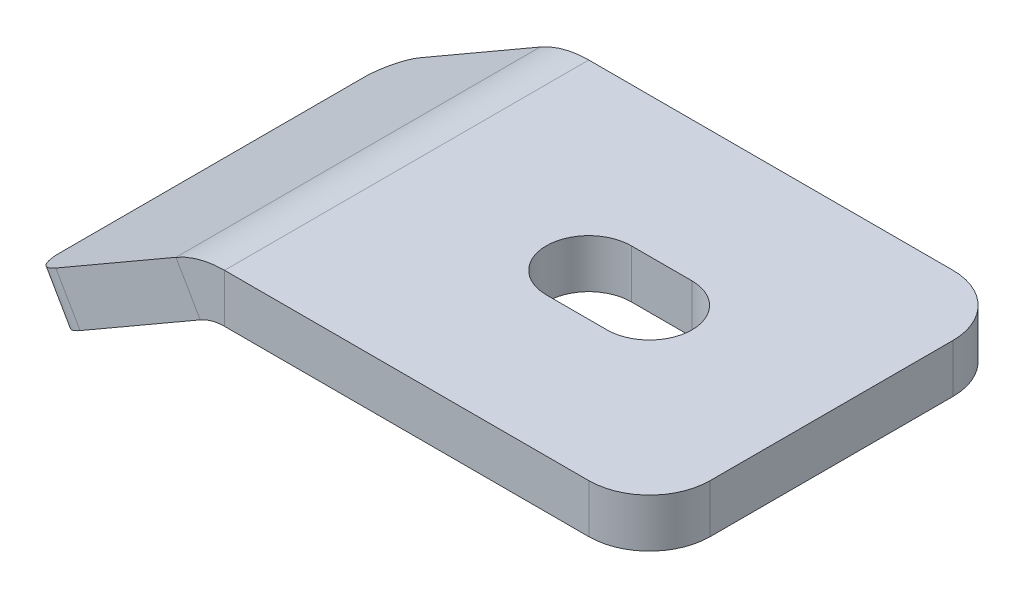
ISO-10303-21;
HEADER;
FILE_DESCRIPTION(('STEP AP214'),'2;1');
FILE_NAME('part.step','',(''),(''),'','','');
FILE_SCHEMA(('AUTOMOTIVE_DESIGN { 1 0 10303 214 1 1 1 1 }'));
ENDSEC;
DATA;
#1=APPLICATION_CONTEXT('core data for automotive mechanical design processes');
#2=APPLICATION_PROTOCOL_DEFINITION('international standard','automotive_design',2000,#1);
#3=PRODUCT_CONTEXT('',#1,'mechanical');
#4=PRODUCT('Part','Part','',(#3));
#5=PRODUCT_RELATED_PRODUCT_CATEGORY('part','',(#4));
#6=PRODUCT_DEFINITION_FORMATION('','',#4);
#7=PRODUCT_DEFINITION_CONTEXT('part definition',#1,'design');
#8=PRODUCT_DEFINITION('design','',#6,#7);
#9=PRODUCT_DEFINITION_SHAPE('','',#8);
#10=(LENGTH_UNIT() NAMED_UNIT(*) SI_UNIT(.MILLI.,.METRE.));
#11=(NAMED_UNIT(*) PLANE_ANGLE_UNIT() SI_UNIT($,.RADIAN.));
#12=(NAMED_UNIT(*) SI_UNIT($,.STERADIAN.) SOLID_ANGLE_UNIT());
#13=UNCERTAINTY_MEASURE_WITH_UNIT(LENGTH_MEASURE(1.E-05),#10,'distance_accuracy_value','');
#14=(GEOMETRIC_REPRESENTATION_CONTEXT(3) GLOBAL_UNCERTAINTY_ASSIGNED_CONTEXT((#13)) GLOBAL_UNIT_ASSIGNED_CONTEXT((#10,
#11,#12)) REPRESENTATION_CONTEXT('',''));
#15=CARTESIAN_POINT('',(0.,0.,0.));
#16=DIRECTION('',(0.,0.,1.));
#17=DIRECTION('',(1.,0.,0.));
#18=AXIS2_PLACEMENT_3D('',#15,#16,#17);
#19=CARTESIAN_POINT('',(-58.7942286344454,-20.499999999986,30.0000000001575));
#20=DIRECTION('',(0.,0.,1.));
#21=DIRECTION('',(0.866025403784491,0.500000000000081,0.));
#22=AXIS2_PLACEMENT_3D('',#19,#20,#21);
#23=PLANE('',#22);
#24=DIRECTION('',(0.866025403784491,0.500000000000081,0.));
#25=VECTOR('',#24,1.);
#26=CARTESIAN_POINT('',(-58.7942286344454,-20.499999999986,30.0000000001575));
#27=LINE('',#26,#25);
#28=CARTESIAN_POINT('',(-58.7942286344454,-20.499999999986,30.0000000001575));
#29=VERTEX_POINT('',#28);
#30=CARTESIAN_POINT('',(-39.0000000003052,-9.07179676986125,30.0000000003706));
#31=VERTEX_POINT('',#30);
#32=EDGE_CURVE('E279',#29,#31,#27,.T.);
#33=ORIENTED_EDGE('',*,*,#32,.T.);
#34=DIRECTION('',(-0.499999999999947,0.866025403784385,0.));
#35=VECTOR('',#34,1.);
#36=CARTESIAN_POINT('',(-39.0000000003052,-9.07179676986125,30.0000000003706));
#37=LINE('',#36,#35);
#38=CARTESIAN_POINT('',(-43.0000000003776,-2.14359353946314,30.0000000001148));
#39=VERTEX_POINT('',#38);
#40=EDGE_CURVE('E12',#31,#39,#37,.T.);
#41=ORIENTED_EDGE('',*,*,#40,.T.);
#42=DIRECTION('',(0.866025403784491,0.500000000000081,0.));
#43=VECTOR('',#42,1.);
#44=CARTESIAN_POINT('',(-62.794228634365,-13.5717967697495,29.9999999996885));
#45=LINE('',#44,#43);
#46=CARTESIAN_POINT('',(-62.794228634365,-13.5717967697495,29.9999999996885));
#47=VERTEX_POINT('',#46);
#48=EDGE_CURVE('E58',#47,#39,#45,.T.);
#49=ORIENTED_EDGE('',*,*,#48,.F.);
#50=DIRECTION('',(-0.499999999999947,0.866025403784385,0.));
#51=VECTOR('',#50,1.);
#52=CARTESIAN_POINT('',(-58.7942286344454,-20.499999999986,30.0000000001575));
#53=LINE('',#52,#51);
#54=EDGE_CURVE('E181',#29,#47,#53,.T.);
#55=ORIENTED_EDGE('',*,*,#54,.F.);
#56=EDGE_LOOP('',(#33,#41,#49,#55));
#57=FACE_BOUND('',#56,.T.);
#58=ADVANCED_FACE('F42',(#57),#23,.T.);
#59=CARTESIAN_POINT('',(-58.7942286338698,-20.499999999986,-29.9999999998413));
#60=DIRECTION('',(0.,0.,-1.));
#61=DIRECTION('',(-0.866025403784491,-0.500000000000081,0.));
#62=AXIS2_PLACEMENT_3D('',#59,#60,#61);
#63=PLANE('',#62);
#64=DIRECTION('',(-0.866025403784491,-0.500000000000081,0.));
#65=VECTOR('',#64,1.);
#66=CARTESIAN_POINT('',(-62.7942286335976,-13.5717967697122,-30.0000000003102));
#67=LINE('',#66,#65);
#68=CARTESIAN_POINT('',(-42.9999999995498,-2.14359353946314,-29.9999999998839));
#69=VERTEX_POINT('',#68);
#70=CARTESIAN_POINT('',(-62.7942286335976,-13.5717967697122,-30.0000000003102));
#71=VERTEX_POINT('',#70);
#72=EDGE_CURVE('E65',#69,#71,#67,.T.);
#73=ORIENTED_EDGE('',*,*,#72,.F.);
#74=DIRECTION('',(0.499999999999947,-0.866025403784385,0.));
#75=VECTOR('',#74,1.);
#76=CARTESIAN_POINT('',(-38.999999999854,-9.07179676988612,-29.9999999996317));
#77=LINE('',#76,#75);
#78=CARTESIAN_POINT('',(-38.999999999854,-9.07179676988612,-29.9999999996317));
#79=VERTEX_POINT('',#78);
#80=EDGE_CURVE('E154',#69,#79,#77,.T.);
#81=ORIENTED_EDGE('',*,*,#80,.T.);
#82=DIRECTION('',(-0.866025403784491,-0.500000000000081,0.));
#83=VECTOR('',#82,1.);
#84=CARTESIAN_POINT('',(-58.7942286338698,-20.499999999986,-29.9999999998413));
#85=LINE('',#84,#83);
#86=CARTESIAN_POINT('',(-58.7942286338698,-20.499999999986,-29.9999999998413));
#87=VERTEX_POINT('',#86);
#88=EDGE_CURVE('E45',#79,#87,#85,.T.);
#89=ORIENTED_EDGE('',*,*,#88,.T.);
#90=DIRECTION('',(-0.499999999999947,0.866025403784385,0.));
#91=VECTOR('',#90,1.);
#92=CARTESIAN_POINT('',(-58.7942286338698,-20.499999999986,-29.9999999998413));
#93=LINE('',#92,#91);
#94=EDGE_CURVE('E293',#87,#71,#93,.T.);
#95=ORIENTED_EDGE('',*,*,#94,.T.);
#96=EDGE_LOOP('',(#73,#81,#89,#95));
#97=FACE_BOUND('',#96,.T.);
#98=ADVANCED_FACE('F156',(#97),#63,.T.);
#99=CARTESIAN_POINT('',(14.4029223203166,30.9979991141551,20.0000000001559));
#100=DIRECTION('',(-0.499999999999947,0.866025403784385,0.));
#101=DIRECTION('',(0.,0.,1.));
#102=AXIS2_PLACEMENT_3D('',#99,#100,#101);
#103=PLANE('',#102);
#104=ORIENTED_EDGE('',*,*,#48,.T.);
#105=DIRECTION('',(0.,0.,-1.));
#106=VECTOR('',#105,1.);
#107=CARTESIAN_POINT('',(-42.9999999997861,-2.14359353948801,20.0000000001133));
#108=LINE('',#107,#106);
#109=EDGE_CURVE('E50',#39,#69,#108,.T.);
#110=ORIENTED_EDGE('',*,*,#109,.T.);
#111=ORIENTED_EDGE('',*,*,#72,.T.);
#112=CARTESIAN_POINT('',(-62.794228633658,-13.5717967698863,-25.0000000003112));
#113=DIRECTION('',(-0.499999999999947,0.866025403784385,0.));
#114=DIRECTION('',(0.,0.,-1.));
#115=AXIS2_PLACEMENT_3D('',#112,#113,#114);
#116=CIRCLE('',#115,5.);
#117=CARTESIAN_POINT('',(-67.1243556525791,-16.0717967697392,-25.000000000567));
#118=VERTEX_POINT('',#117);
#119=EDGE_CURVE('E280',#71,#118,#116,.T.);
#120=ORIENTED_EDGE('',*,*,#119,.T.);
#121=DIRECTION('',(0.,0.,1.));
#122=VECTOR('',#121,1.);
#123=CARTESIAN_POINT('',(-67.1243556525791,-16.0717967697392,-25.000000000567));
#124=LINE('',#123,#122);
#125=CARTESIAN_POINT('',(-67.1243556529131,-16.071796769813,24.9999999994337));
#126=VERTEX_POINT('',#125);
#127=EDGE_CURVE('E283',#118,#126,#124,.T.);
#128=ORIENTED_EDGE('',*,*,#127,.T.);
#129=CARTESIAN_POINT('',(-62.7942286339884,-13.5717967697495,24.9999999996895));
#130=DIRECTION('',(-0.499999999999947,0.866025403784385,0.));
#131=DIRECTION('',(0.,0.,-1.));
#132=AXIS2_PLACEMENT_3D('',#129,#130,#131);
#133=CIRCLE('',#132,5.);
#134=EDGE_CURVE('E286',#126,#47,#133,.T.);
#135=ORIENTED_EDGE('',*,*,#134,.T.);
#136=EDGE_LOOP('',(#104,#110,#111,#120,#128,#135));
#137=FACE_BOUND('',#136,.T.);
#138=ADVANCED_FACE('F297',(#137),#103,.T.);
#139=CARTESIAN_POINT('',(-58.7942286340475,-20.5000000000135,25.0000000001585));
#140=DIRECTION('',(-0.499999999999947,0.866025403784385,0.));
#141=DIRECTION('',(0.,0.,1.));
#142=AXIS2_PLACEMENT_3D('',#139,#140,#141);
#143=CYLINDRICAL_SURFACE('',#142,5.);
#144=ORIENTED_EDGE('',*,*,#134,.F.);
#145=DIRECTION('',(-0.499999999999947,0.866025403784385,0.));
#146=VECTOR('',#145,1.);
#147=CARTESIAN_POINT('',(-63.1243556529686,-23.0000000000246,25.0000000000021));
#148=LINE('',#147,#146);
#149=CARTESIAN_POINT('',(-63.1243556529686,-23.0000000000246,25.0000000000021));
#150=VERTEX_POINT('',#149);
#151=EDGE_CURVE('E289',#150,#126,#148,.T.);
#152=ORIENTED_EDGE('',*,*,#151,.F.);
#153=CARTESIAN_POINT('',(-58.7942286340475,-20.5000000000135,25.0000000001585));
#154=DIRECTION('',(-0.499999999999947,0.866025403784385,0.));
#155=DIRECTION('',(0.,0.,-1.));
#156=AXIS2_PLACEMENT_3D('',#153,#154,#155);
#157=CIRCLE('',#156,5.);
#158=EDGE_CURVE('E276',#150,#29,#157,.T.);
#159=ORIENTED_EDGE('',*,*,#158,.T.);
#160=ORIENTED_EDGE('',*,*,#54,.T.);
#161=EDGE_LOOP('',(#144,#152,#159,#160));
#162=FACE_BOUND('',#161,.T.);
#163=ADVANCED_FACE('F359',(#162),#143,.T.);
#164=CARTESIAN_POINT('',(-63.1243556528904,-23.0000000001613,-24.9999999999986));
#165=DIRECTION('',(-0.866025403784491,-0.500000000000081,0.));
#166=DIRECTION('',(0.,0.,1.));
#167=AXIS2_PLACEMENT_3D('',#164,#165,#166);
#168=PLANE('',#167);
#169=ORIENTED_EDGE('',*,*,#127,.F.);
#170=DIRECTION('',(-0.499999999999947,0.866025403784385,0.));
#171=VECTOR('',#170,1.);
#172=CARTESIAN_POINT('',(-63.1243556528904,-23.0000000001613,-24.9999999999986));
#173=LINE('',#172,#171);
#174=CARTESIAN_POINT('',(-63.1243556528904,-23.0000000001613,-24.9999999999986));
#175=VERTEX_POINT('',#174);
#176=EDGE_CURVE('E291',#175,#118,#173,.T.);
#177=ORIENTED_EDGE('',*,*,#176,.F.);
#178=DIRECTION('',(0.,0.,1.));
#179=VECTOR('',#178,1.);
#180=CARTESIAN_POINT('',(-63.1243556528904,-23.0000000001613,-24.9999999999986));
#181=LINE('',#180,#179);
#182=EDGE_CURVE('E273',#175,#150,#181,.T.);
#183=ORIENTED_EDGE('',*,*,#182,.T.);
#184=ORIENTED_EDGE('',*,*,#151,.T.);
#185=EDGE_LOOP('',(#169,#177,#183,#184));
#186=FACE_BOUND('',#185,.T.);
#187=ADVANCED_FACE('F304',(#186),#168,.T.);
#188=CARTESIAN_POINT('',(-58.7942286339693,-20.4999999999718,-24.9999999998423));
#189=DIRECTION('',(-0.499999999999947,0.866025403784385,0.));
#190=DIRECTION('',(0.,0.,1.));
#191=AXIS2_PLACEMENT_3D('',#188,#189,#190);
#192=CYLINDRICAL_SURFACE('',#191,5.);
#193=ORIENTED_EDGE('',*,*,#119,.F.);
#194=ORIENTED_EDGE('',*,*,#94,.F.);
#195=CARTESIAN_POINT('',(-58.7942286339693,-20.4999999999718,-24.9999999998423));
#196=DIRECTION('',(-0.499999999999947,0.866025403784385,0.));
#197=DIRECTION('',(0.,0.,-1.));
#198=AXIS2_PLACEMENT_3D('',#195,#196,#197);
#199=CIRCLE('',#198,5.);
#200=EDGE_CURVE('E172',#87,#175,#199,.T.);
#201=ORIENTED_EDGE('',*,*,#200,.T.);
#202=ORIENTED_EDGE('',*,*,#176,.T.);
#203=EDGE_LOOP('',(#193,#194,#201,#202));
#204=FACE_BOUND('',#203,.T.);
#205=ADVANCED_FACE('F301',(#204),#192,.T.);
#206=CARTESIAN_POINT('',(18.4029223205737,24.0697958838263,20.0000000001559));
#207=DIRECTION('',(-0.499999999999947,0.866025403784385,0.));
#208=DIRECTION('',(0.,0.,1.));
#209=AXIS2_PLACEMENT_3D('',#206,#207,#208);
#210=PLANE('',#209);
#211=DIRECTION('',(0.,0.,-1.));
#212=VECTOR('',#211,1.);
#213=CARTESIAN_POINT('',(-39.0000000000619,-9.07179676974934,20.0000000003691));
#214=LINE('',#213,#212);
#215=EDGE_CURVE('E162',#31,#79,#214,.T.);
#216=ORIENTED_EDGE('',*,*,#215,.F.);
#217=ORIENTED_EDGE('',*,*,#32,.F.);
#218=ORIENTED_EDGE('',*,*,#158,.F.);
#219=ORIENTED_EDGE('',*,*,#182,.F.);
#220=ORIENTED_EDGE('',*,*,#200,.F.);
#221=ORIENTED_EDGE('',*,*,#88,.F.);
#222=EDGE_LOOP('',(#216,#217,#218,#219,#220,#221));
#223=FACE_BOUND('',#222,.T.);
#224=ADVANCED_FACE('F167',(#223),#210,.F.);
#225=CARTESIAN_POINT('',(25.0000000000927,-7.99999999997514,20.0000000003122));
#226=DIRECTION('',(0.,1.,0.));
#227=DIRECTION('',(0.,0.,1.));
#228=AXIS2_PLACEMENT_3D('',#225,#226,#227);
#229=CYLINDRICAL_SURFACE('',#228,10.);
#230=CARTESIAN_POINT('',(25.0000000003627,2.48689957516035E-11,20.0000000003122));
#231=DIRECTION('',(0.,1.,0.));
#232=DIRECTION('',(0.,0.,1.));
#233=AXIS2_PLACEMENT_3D('',#230,#231,#232);
#234=CIRCLE('',#233,10.);
#235=CARTESIAN_POINT('',(24.9999999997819,-1.65201186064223E-10,30.0000000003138));
#236=VERTEX_POINT('',#235);
#237=CARTESIAN_POINT('',(35.0000000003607,-1.36779476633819E-10,19.9999999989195));
#238=VERTEX_POINT('',#237);
#239=EDGE_CURVE('E212',#236,#238,#234,.T.);
#240=ORIENTED_EDGE('',*,*,#239,.F.);
#241=DIRECTION('',(0.,1.,0.));
#242=VECTOR('',#241,1.);
#243=CARTESIAN_POINT('',(24.9999999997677,-8.00000000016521,30.0000000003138));
#244=LINE('',#243,#242);
#245=CARTESIAN_POINT('',(24.9999999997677,-8.00000000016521,30.0000000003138));
#246=VERTEX_POINT('',#245);
#247=EDGE_CURVE('E199',#246,#236,#244,.T.);
#248=ORIENTED_EDGE('',*,*,#247,.F.);
#249=CARTESIAN_POINT('',(25.0000000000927,-7.99999999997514,20.0000000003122));
#250=DIRECTION('',(0.,1.,0.));
#251=DIRECTION('',(0.,0.,1.));
#252=AXIS2_PLACEMENT_3D('',#249,#250,#251);
#253=CIRCLE('',#252,10.);
#254=CARTESIAN_POINT('',(35.0000000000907,-8.00000000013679,19.9999999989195));
#255=VERTEX_POINT('',#254);
#256=EDGE_CURVE('E266',#246,#255,#253,.T.);
#257=ORIENTED_EDGE('',*,*,#256,.T.);
#258=DIRECTION('',(0.,1.,0.));
#259=VECTOR('',#258,1.);
#260=CARTESIAN_POINT('',(35.0000000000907,-8.00000000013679,19.9999999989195));
#261=LINE('',#260,#259);
#262=EDGE_CURVE('E264',#255,#238,#261,.T.);
#263=ORIENTED_EDGE('',*,*,#262,.T.);
#264=EDGE_LOOP('',(#240,#248,#257,#263));
#265=FACE_BOUND('',#264,.T.);
#266=ADVANCED_FACE('F334',(#265),#229,.T.);
#267=CARTESIAN_POINT('',(35.0000000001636,-8.00000000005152,-20.0000000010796));
#268=DIRECTION('',(1.,0.,0.));
#269=DIRECTION('',(0.,0.,-1.));
#270=AXIS2_PLACEMENT_3D('',#267,#268,#269);
#271=PLANE('',#270);
#272=DIRECTION('',(0.,0.,-1.));
#273=VECTOR('',#272,1.);
#274=CARTESIAN_POINT('',(35.0000000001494,-5.15143483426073E-11,-20.0000000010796));
#275=LINE('',#274,#273);
#276=CARTESIAN_POINT('',(35.0000000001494,-5.15143483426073E-11,-20.0000000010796));
#277=VERTEX_POINT('',#276);
#278=EDGE_CURVE('E209',#238,#277,#275,.T.);
#279=ORIENTED_EDGE('',*,*,#278,.F.);
#280=ORIENTED_EDGE('',*,*,#262,.F.);
#281=DIRECTION('',(0.,0.,-1.));
#282=VECTOR('',#281,1.);
#283=CARTESIAN_POINT('',(35.0000000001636,-8.00000000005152,-20.0000000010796));
#284=LINE('',#283,#282);
#285=CARTESIAN_POINT('',(35.0000000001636,-8.00000000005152,-20.0000000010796));
#286=VERTEX_POINT('',#285);
#287=EDGE_CURVE('E261',#255,#286,#284,.T.);
#288=ORIENTED_EDGE('',*,*,#287,.T.);
#289=DIRECTION('',(0.,1.,0.));
#290=VECTOR('',#289,1.);
#291=CARTESIAN_POINT('',(35.0000000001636,-8.00000000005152,-20.0000000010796));
#292=LINE('',#291,#290);
#293=EDGE_CURVE('E259',#286,#277,#292,.T.);
#294=ORIENTED_EDGE('',*,*,#293,.T.);
#295=EDGE_LOOP('',(#279,#280,#288,#294));
#296=FACE_BOUND('',#295,.T.);
#297=ADVANCED_FACE('F337',(#296),#271,.T.);
#298=CARTESIAN_POINT('',(25.000000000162,-8.00000000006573,-19.9999999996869));
#299=DIRECTION('',(0.,1.,0.));
#300=DIRECTION('',(0.,0.,1.));
#301=AXIS2_PLACEMENT_3D('',#298,#299,#300);
#302=CYLINDRICAL_SURFACE('',#301,10.);
#303=CARTESIAN_POINT('',(25.0000000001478,-6.57252030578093E-11,-19.9999999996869));
#304=DIRECTION('',(0.,1.,0.));
#305=DIRECTION('',(0.,0.,1.));
#306=AXIS2_PLACEMENT_3D('',#303,#304,#305);
#307=CIRCLE('',#306,10.);
#308=CARTESIAN_POINT('',(25.0000000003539,-1.52766688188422E-10,-29.9999999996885));
#309=VERTEX_POINT('',#308);
#310=EDGE_CURVE('E206',#277,#309,#307,.T.);
#311=ORIENTED_EDGE('',*,*,#310,.F.);
#312=ORIENTED_EDGE('',*,*,#293,.F.);
#313=CARTESIAN_POINT('',(25.000000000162,-8.00000000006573,-19.9999999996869));
#314=DIRECTION('',(0.,1.,0.));
#315=DIRECTION('',(0.,0.,1.));
#316=AXIS2_PLACEMENT_3D('',#313,#314,#315);
#317=CIRCLE('',#316,10.);
#318=CARTESIAN_POINT('',(25.0000000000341,-8.00000000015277,-29.9999999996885));
#319=VERTEX_POINT('',#318);
#320=EDGE_CURVE('E256',#286,#319,#317,.T.);
#321=ORIENTED_EDGE('',*,*,#320,.T.);
#322=DIRECTION('',(0.,1.,0.));
#323=VECTOR('',#322,1.);
#324=CARTESIAN_POINT('',(25.0000000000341,-8.00000000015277,-29.9999999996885));
#325=LINE('',#324,#323);
#326=EDGE_CURVE('E254',#319,#309,#325,.T.);
#327=ORIENTED_EDGE('',*,*,#326,.T.);
#328=EDGE_LOOP('',(#311,#312,#321,#327));
#329=FACE_BOUND('',#328,.T.);
#330=ADVANCED_FACE('F339',(#329),#302,.T.);
#331=CARTESIAN_POINT('',(4.99999999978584,-8.00000000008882,0.));
#332=DIRECTION('',(0.,1.,0.));
#333=DIRECTION('',(0.,0.,1.));
#334=AXIS2_PLACEMENT_3D('',#331,#332,#333);
#335=CYLINDRICAL_SURFACE('',#334,7.);
#336=CARTESIAN_POINT('',(4.99999999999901,-8.88178419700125E-11,0.));
#337=DIRECTION('',(0.,1.,0.));
#338=DIRECTION('',(0.,0.,1.));
#339=AXIS2_PLACEMENT_3D('',#336,#337,#338);
#340=CIRCLE('',#339,7.);
#341=CARTESIAN_POINT('',(4.99999999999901,-3.90798504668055E-11,7.00000000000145));
#342=VERTEX_POINT('',#341);
#343=CARTESIAN_POINT('',(5.0000000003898,6.21724893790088E-11,-7.00000000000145));
#344=VERTEX_POINT('',#343);
#345=EDGE_CURVE('E251',#342,#344,#340,.T.);
#346=ORIENTED_EDGE('',*,*,#345,.T.);
#347=DIRECTION('',(0.,1.,0.));
#348=VECTOR('',#347,1.);
#349=CARTESIAN_POINT('',(5.00000000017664,-8.00000000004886,-7.00000000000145));
#350=LINE('',#349,#348);
#351=CARTESIAN_POINT('',(5.00000000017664,-8.00000000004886,-7.00000000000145));
#352=VERTEX_POINT('',#351);
#353=EDGE_CURVE('E234',#352,#344,#350,.T.);
#354=ORIENTED_EDGE('',*,*,#353,.F.);
#355=CARTESIAN_POINT('',(4.99999999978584,-8.00000000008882,0.));
#356=DIRECTION('',(0.,1.,0.));
#357=DIRECTION('',(0.,0.,1.));
#358=AXIS2_PLACEMENT_3D('',#355,#356,#357);
#359=CIRCLE('',#358,7.);
#360=CARTESIAN_POINT('',(4.99999999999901,-8.00000000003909,7.00000000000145));
#361=VERTEX_POINT('',#360);
#362=EDGE_CURVE('E222',#361,#352,#359,.T.);
#363=ORIENTED_EDGE('',*,*,#362,.F.);
#364=DIRECTION('',(0.,1.,0.));
#365=VECTOR('',#364,1.);
#366=CARTESIAN_POINT('',(4.99999999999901,-8.00000000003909,7.00000000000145));
#367=LINE('',#366,#365);
#368=EDGE_CURVE('E249',#361,#342,#367,.T.);
#369=ORIENTED_EDGE('',*,*,#368,.T.);
#370=EDGE_LOOP('',(#346,#354,#363,#369));
#371=FACE_BOUND('',#370,.T.);
#372=ADVANCED_FACE('F341',(#371),#335,.F.);
#373=CARTESIAN_POINT('',(-4.99999999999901,-8.00000000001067,6.99999999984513));
#374=DIRECTION('',(0.,0.,1.));
#375=DIRECTION('',(1.,0.,0.));
#376=AXIS2_PLACEMENT_3D('',#373,#374,#375);
#377=PLANE('',#376);
#378=DIRECTION('',(1.,0.,0.));
#379=VECTOR('',#378,1.);
#380=CARTESIAN_POINT('',(-4.99999999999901,-9.76996261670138E-11,6.99999999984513));
#381=LINE('',#380,#379);
#382=CARTESIAN_POINT('',(-4.99999999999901,-9.76996261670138E-11,6.99999999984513));
#383=VERTEX_POINT('',#382);
#384=EDGE_CURVE('E246',#383,#342,#381,.T.);
#385=ORIENTED_EDGE('',*,*,#384,.T.);
#386=ORIENTED_EDGE('',*,*,#368,.F.);
#387=DIRECTION('',(1.,0.,0.));
#388=VECTOR('',#387,1.);
#389=CARTESIAN_POINT('',(-4.99999999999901,-8.00000000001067,6.99999999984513));
#390=LINE('',#389,#388);
#391=CARTESIAN_POINT('',(-4.99999999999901,-8.00000000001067,6.99999999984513));
#392=VERTEX_POINT('',#391);
#393=EDGE_CURVE('E225',#392,#361,#390,.T.);
#394=ORIENTED_EDGE('',*,*,#393,.F.);
#395=DIRECTION('',(0.,1.,0.));
#396=VECTOR('',#395,1.);
#397=CARTESIAN_POINT('',(-4.99999999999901,-8.00000000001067,6.99999999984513));
#398=LINE('',#397,#396);
#399=EDGE_CURVE('E243',#392,#383,#398,.T.);
#400=ORIENTED_EDGE('',*,*,#399,.T.);
#401=EDGE_LOOP('',(#385,#386,#394,#400));
#402=FACE_BOUND('',#401,.T.);
#403=ADVANCED_FACE('F347',(#402),#377,.F.);
#404=CARTESIAN_POINT('',(-5.00000000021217,-7.99999999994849,-1.56319401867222E-10));
#405=DIRECTION('',(0.,1.,0.));
#406=DIRECTION('',(0.,0.,1.));
#407=AXIS2_PLACEMENT_3D('',#404,#405,#406);
#408=CYLINDRICAL_SURFACE('',#407,7.);
#409=CARTESIAN_POINT('',(-4.99999999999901,5.15143483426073E-11,-1.56319401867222E-10));
#410=DIRECTION('',(0.,1.,0.));
#411=DIRECTION('',(0.,0.,1.));
#412=AXIS2_PLACEMENT_3D('',#409,#410,#411);
#413=CIRCLE('',#412,7.);
#414=CARTESIAN_POINT('',(-4.99999999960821,1.4210854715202E-11,-7.00000000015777));
#415=VERTEX_POINT('',#414);
#416=EDGE_CURVE('E241',#415,#383,#413,.T.);
#417=ORIENTED_EDGE('',*,*,#416,.T.);
#418=ORIENTED_EDGE('',*,*,#399,.F.);
#419=CARTESIAN_POINT('',(-5.00000000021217,-7.99999999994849,-1.56319401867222E-10));
#420=DIRECTION('',(0.,1.,0.));
#421=DIRECTION('',(0.,0.,1.));
#422=AXIS2_PLACEMENT_3D('',#419,#420,#421);
#423=CIRCLE('',#422,7.);
#424=CARTESIAN_POINT('',(-4.99999999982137,-7.9999999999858,-7.00000000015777));
#425=VERTEX_POINT('',#424);
#426=EDGE_CURVE('E228',#425,#392,#423,.T.);
#427=ORIENTED_EDGE('',*,*,#426,.F.);
#428=DIRECTION('',(0.,1.,0.));
#429=VECTOR('',#428,1.);
#430=CARTESIAN_POINT('',(-4.99999999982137,-7.9999999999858,-7.00000000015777));
#431=LINE('',#430,#429);
#432=EDGE_CURVE('E239',#425,#415,#431,.T.);
#433=ORIENTED_EDGE('',*,*,#432,.T.);
#434=EDGE_LOOP('',(#417,#418,#427,#433));
#435=FACE_BOUND('',#434,.T.);
#436=ADVANCED_FACE('F381',(#435),#408,.F.);
#437=CARTESIAN_POINT('',(-4.99999999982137,-7.9999999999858,-7.00000000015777));
#438=DIRECTION('',(0.,0.,-1.));
#439=DIRECTION('',(-1.,0.,0.));
#440=AXIS2_PLACEMENT_3D('',#437,#438,#439);
#441=PLANE('',#440);
#442=DIRECTION('',(-1.,0.,0.));
#443=VECTOR('',#442,1.);
#444=CARTESIAN_POINT('',(-4.99999999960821,1.4210854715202E-11,-7.00000000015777));
#445=LINE('',#444,#443);
#446=EDGE_CURVE('E236',#344,#415,#445,.T.);
#447=ORIENTED_EDGE('',*,*,#446,.T.);
#448=ORIENTED_EDGE('',*,*,#432,.F.);
#449=DIRECTION('',(-1.,0.,0.));
#450=VECTOR('',#449,1.);
#451=CARTESIAN_POINT('',(-4.99999999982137,-7.9999999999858,-7.00000000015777));
#452=LINE('',#451,#450);
#453=EDGE_CURVE('E231',#352,#425,#452,.T.);
#454=ORIENTED_EDGE('',*,*,#453,.F.);
#455=ORIENTED_EDGE('',*,*,#353,.T.);
#456=EDGE_LOOP('',(#447,#448,#454,#455));
#457=FACE_BOUND('',#456,.T.);
#458=ADVANCED_FACE('F377',(#457),#441,.F.);
#459=CARTESIAN_POINT('',(25.0000000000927,-7.99999999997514,20.0000000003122));
#460=DIRECTION('',(0.,1.,0.));
#461=DIRECTION('',(0.,0.,1.));
#462=AXIS2_PLACEMENT_3D('',#459,#460,#461);
#463=PLANE('',#462);
#464=ORIENTED_EDGE('',*,*,#453,.T.);
#465=ORIENTED_EDGE('',*,*,#426,.T.);
#466=ORIENTED_EDGE('',*,*,#393,.T.);
#467=ORIENTED_EDGE('',*,*,#362,.T.);
#468=EDGE_LOOP('',(#464,#465,#466,#467));
#469=FACE_BOUND('',#468,.T.);
#470=DIRECTION('',(1.,0.,0.));
#471=VECTOR('',#470,1.);
#472=CARTESIAN_POINT('',(-64.1395917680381,-7.9999999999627,29.9999999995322));
#473=LINE('',#472,#471);
#474=CARTESIAN_POINT('',(-35.0000000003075,-7.99999999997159,29.9999999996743));
#475=VERTEX_POINT('',#474);
#476=EDGE_CURVE('E202',#475,#246,#473,.T.);
#477=ORIENTED_EDGE('',*,*,#476,.F.);
#478=DIRECTION('',(0.,0.,-1.));
#479=VECTOR('',#478,1.);
#480=CARTESIAN_POINT('',(-35.0000000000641,-8.00000000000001,19.9999999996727));
#481=LINE('',#480,#479);
#482=CARTESIAN_POINT('',(-34.9999999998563,-7.99999999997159,-30.000000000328));
#483=VERTEX_POINT('',#482);
#484=EDGE_CURVE('E219',#475,#483,#481,.T.);
#485=ORIENTED_EDGE('',*,*,#484,.T.);
#486=DIRECTION('',(-1.,0.,0.));
#487=VECTOR('',#486,1.);
#488=CARTESIAN_POINT('',(-64.1395917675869,-8.00000000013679,-30.0000000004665));
#489=LINE('',#488,#487);
#490=EDGE_CURVE('E217',#319,#483,#489,.T.);
#491=ORIENTED_EDGE('',*,*,#490,.F.);
#492=ORIENTED_EDGE('',*,*,#320,.F.);
#493=ORIENTED_EDGE('',*,*,#287,.F.);
#494=ORIENTED_EDGE('',*,*,#256,.F.);
#495=EDGE_LOOP('',(#477,#485,#491,#492,#493,#494));
#496=FACE_BOUND('',#495,.T.);
#497=ADVANCED_FACE('F330',(#469,#496),#463,.F.);
#498=CARTESIAN_POINT('',(-64.1395917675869,-8.00000000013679,-30.0000000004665));
#499=DIRECTION('',(0.,0.,-1.));
#500=DIRECTION('',(-1.,0.,0.));
#501=AXIS2_PLACEMENT_3D('',#498,#499,#500);
#502=PLANE('',#501);
#503=DIRECTION('',(0.,-1.,0.));
#504=VECTOR('',#503,1.);
#505=CARTESIAN_POINT('',(-34.9999999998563,-7.99999999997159,-30.000000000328));
#506=LINE('',#505,#504);
#507=CARTESIAN_POINT('',(-34.9999999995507,2.8421709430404E-11,-29.9999999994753));
#508=VERTEX_POINT('',#507);
#509=EDGE_CURVE('E186',#508,#483,#506,.T.);
#510=ORIENTED_EDGE('',*,*,#509,.F.);
#511=DIRECTION('',(-1.,0.,0.));
#512=VECTOR('',#511,1.);
#513=CARTESIAN_POINT('',(-64.1395917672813,-1.36779476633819E-10,-30.0000000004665));
#514=LINE('',#513,#512);
#515=EDGE_CURVE('E204',#309,#508,#514,.T.);
#516=ORIENTED_EDGE('',*,*,#515,.F.);
#517=ORIENTED_EDGE('',*,*,#326,.F.);
#518=ORIENTED_EDGE('',*,*,#490,.T.);
#519=EDGE_LOOP('',(#510,#516,#517,#518));
#520=FACE_BOUND('',#519,.T.);
#521=ADVANCED_FACE('F326',(#520),#502,.T.);
#522=CARTESIAN_POINT('',(25.0000000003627,2.48689957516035E-11,20.0000000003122));
#523=DIRECTION('',(0.,1.,0.));
#524=DIRECTION('',(0.,0.,1.));
#525=AXIS2_PLACEMENT_3D('',#522,#523,#524);
#526=PLANE('',#525);
#527=DIRECTION('',(0.,0.,-1.));
#528=VECTOR('',#527,1.);
#529=CARTESIAN_POINT('',(-34.999999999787,0.,20.0000000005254));
#530=LINE('',#529,#528);
#531=CARTESIAN_POINT('',(-35.0000000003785,2.8421709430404E-11,30.0000000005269));
#532=VERTEX_POINT('',#531);
#533=EDGE_CURVE('E190',#532,#508,#530,.T.);
#534=ORIENTED_EDGE('',*,*,#533,.F.);
#535=DIRECTION('',(1.,0.,0.));
#536=VECTOR('',#535,1.);
#537=CARTESIAN_POINT('',(-64.1395917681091,3.73034936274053E-11,29.9999999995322));
#538=LINE('',#537,#536);
#539=EDGE_CURVE('E215',#532,#236,#538,.T.);
#540=ORIENTED_EDGE('',*,*,#539,.T.);
#541=ORIENTED_EDGE('',*,*,#239,.T.);
#542=ORIENTED_EDGE('',*,*,#278,.T.);
#543=ORIENTED_EDGE('',*,*,#310,.T.);
#544=ORIENTED_EDGE('',*,*,#515,.T.);
#545=EDGE_LOOP('',(#534,#540,#541,#542,#543,#544));
#546=FACE_BOUND('',#545,.T.);
#547=ORIENTED_EDGE('',*,*,#416,.F.);
#548=ORIENTED_EDGE('',*,*,#446,.F.);
#549=ORIENTED_EDGE('',*,*,#345,.F.);
#550=ORIENTED_EDGE('',*,*,#384,.F.);
#551=EDGE_LOOP('',(#547,#548,#549,#550));
#552=FACE_BOUND('',#551,.T.);
#553=ADVANCED_FACE('F321',(#546,#552),#526,.T.);
#554=CARTESIAN_POINT('',(-64.1395917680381,-7.9999999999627,29.9999999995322));
#555=DIRECTION('',(0.,0.,1.));
#556=DIRECTION('',(1.,0.,0.));
#557=AXIS2_PLACEMENT_3D('',#554,#555,#556);
#558=PLANE('',#557);
#559=DIRECTION('',(0.,1.,0.));
#560=VECTOR('',#559,1.);
#561=CARTESIAN_POINT('',(-35.0000000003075,-7.99999999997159,29.9999999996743));
#562=LINE('',#561,#560);
#563=EDGE_CURVE('E187',#475,#532,#562,.T.);
#564=ORIENTED_EDGE('',*,*,#563,.F.);
#565=ORIENTED_EDGE('',*,*,#476,.T.);
#566=ORIENTED_EDGE('',*,*,#247,.T.);
#567=ORIENTED_EDGE('',*,*,#539,.F.);
#568=EDGE_LOOP('',(#564,#565,#566,#567));
#569=FACE_BOUND('',#568,.T.);
#570=ADVANCED_FACE('F316',(#569),#558,.T.);
#571=CARTESIAN_POINT('',(-35.0000000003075,-15.9999999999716,29.9999999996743));
#572=DIRECTION('',(0.,0.,-1.));
#573=DIRECTION('',(-1.,0.,0.));
#574=AXIS2_PLACEMENT_3D('',#571,#572,#573);
#575=PLANE('',#574);
#576=ORIENTED_EDGE('',*,*,#563,.T.);
#577=CARTESIAN_POINT('',(-35.0000000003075,-15.9999999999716,29.9999999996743));
#578=DIRECTION('',(0.,0.,-1.));
#579=DIRECTION('',(-1.,0.,0.));
#580=AXIS2_PLACEMENT_3D('',#577,#578,#579);
#581=CIRCLE('',#580,16.);
#582=EDGE_CURVE('E196',#532,#39,#581,.F.);
#583=ORIENTED_EDGE('',*,*,#582,.T.);
#584=ORIENTED_EDGE('',*,*,#40,.F.);
#585=CARTESIAN_POINT('',(-35.0000000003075,-15.9999999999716,29.9999999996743));
#586=DIRECTION('',(0.,0.,1.));
#587=DIRECTION('',(-1.,0.,0.));
#588=AXIS2_PLACEMENT_3D('',#585,#586,#587);
#589=CIRCLE('',#588,8.);
#590=EDGE_CURVE('E180',#475,#31,#589,.T.);
#591=ORIENTED_EDGE('',*,*,#590,.F.);
#592=EDGE_LOOP('',(#576,#583,#584,#591));
#593=FACE_BOUND('',#592,.T.);
#594=ADVANCED_FACE('F313',(#593),#575,.F.);
#595=CARTESIAN_POINT('',(-34.9999999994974,-15.9999999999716,-30.000000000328));
#596=DIRECTION('',(0.,0.,1.));
#597=DIRECTION('',(1.,0.,0.));
#598=AXIS2_PLACEMENT_3D('',#595,#596,#597);
#599=PLANE('',#598);
#600=ORIENTED_EDGE('',*,*,#80,.F.);
#601=CARTESIAN_POINT('',(-34.9999999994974,-15.9999999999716,-30.000000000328));
#602=DIRECTION('',(0.,0.,-1.));
#603=DIRECTION('',(-1.,0.,0.));
#604=AXIS2_PLACEMENT_3D('',#601,#602,#603);
#605=CIRCLE('',#604,16.);
#606=EDGE_CURVE('E192',#69,#508,#605,.T.);
#607=ORIENTED_EDGE('',*,*,#606,.T.);
#608=ORIENTED_EDGE('',*,*,#509,.T.);
#609=CARTESIAN_POINT('',(-34.9999999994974,-15.9999999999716,-30.000000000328));
#610=DIRECTION('',(0.,0.,-1.));
#611=DIRECTION('',(1.,0.,0.));
#612=AXIS2_PLACEMENT_3D('',#609,#610,#611);
#613=CIRCLE('',#612,8.);
#614=EDGE_CURVE('E178',#79,#483,#613,.T.);
#615=ORIENTED_EDGE('',*,*,#614,.F.);
#616=EDGE_LOOP('',(#600,#607,#608,#615));
#617=FACE_BOUND('',#616,.T.);
#618=ADVANCED_FACE('F184',(#617),#599,.F.);
#619=CARTESIAN_POINT('',(-35.0000000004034,-15.9999999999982,60.8562110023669));
#620=DIRECTION('',(0.,0.,-1.));
#621=DIRECTION('',(-1.,0.,0.));
#622=AXIS2_PLACEMENT_3D('',#619,#620,#621);
#623=CYLINDRICAL_SURFACE('',#622,8.);
#624=ORIENTED_EDGE('',*,*,#614,.T.);
#625=ORIENTED_EDGE('',*,*,#484,.F.);
#626=ORIENTED_EDGE('',*,*,#590,.T.);
#627=ORIENTED_EDGE('',*,*,#215,.T.);
#628=EDGE_LOOP('',(#624,#625,#626,#627));
#629=FACE_BOUND('',#628,.T.);
#630=ADVANCED_FACE('F176',(#629),#623,.F.);
#631=CARTESIAN_POINT('',(-35.0000000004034,-15.9999999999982,60.8562110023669));
#632=DIRECTION('',(0.,0.,-1.));
#633=DIRECTION('',(-1.,0.,0.));
#634=AXIS2_PLACEMENT_3D('',#631,#632,#633);
#635=CYLINDRICAL_SURFACE('',#634,16.);
#636=ORIENTED_EDGE('',*,*,#606,.F.);
#637=ORIENTED_EDGE('',*,*,#109,.F.);
#638=ORIENTED_EDGE('',*,*,#582,.F.);
#639=ORIENTED_EDGE('',*,*,#533,.T.);
#640=EDGE_LOOP('',(#636,#637,#638,#639));
#641=FACE_BOUND('',#640,.T.);
#642=ADVANCED_FACE('F312',(#641),#635,.T.);
#643=CLOSED_SHELL('',(#58,#98,#138,#163,#187,#205,#224,#266,#297,#330,#372,#403,#436,#458,#497,
#521,#553,#570,#594,#618,#630,#642));
#644=MANIFOLD_SOLID_BREP('B2',#643);
#645=ADVANCED_BREP_SHAPE_REPRESENTATION('',(#18,#644),#14);
#646=SHAPE_DEFINITION_REPRESENTATION(#9,#645);
ENDSEC;
END-ISO-10303-21;
